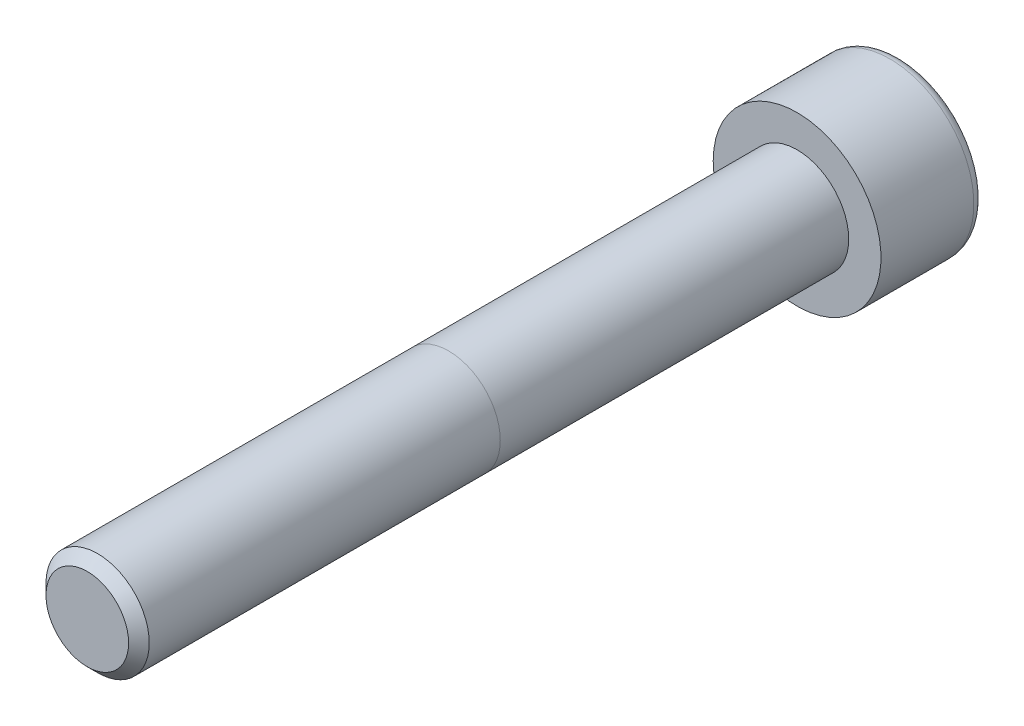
from build123d import *

# Parameters (mm, degrees)
ENLEV_MAT_EXTRU1_DEPTH = 4
ESQUISSE3_W            = 4
ESQUISSE3_H            = 55
CHANFREIN1_SIZE        = 0.8


with BuildPart() as part:
    # Esquisse1 → Base-R_volution (revolve)
    with BuildSketch(Plane(origin=(0, 0, 0), x_dir=(1, 0, 0), z_dir=(0, 1, 0)), mode=Mode.PRIVATE) as base_r_volution_sk:
        with BuildLine():
            Line((0, 0), (6.5, 0))
            Line((6.5, 0), (6.5, 7.2))
            ThreePointArc((6.5, 7.2), (6.265685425, 7.765685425), (5.7, 8))
            Line((5.7, 8), (0, 8))
            Line((0, 8), (0, 0))
        make_face()
    revolve(base_r_volution_sk.sketch.rotate(Axis((0, 0, 0), (0, 0, -1)), 180), axis=Axis((0, 0, 0), (0, 0, -1)))

    # Esquisse2 → enlev-mat-Extru1 (cut)
    with BuildSketch(Plane.XY.offset(-8)):
        Polygon((3, -1.732050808), (3, 1.732050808), (0, 3.464101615), (-3, 1.732050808), (-3, -1.732050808), (0, -3.464101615), align=None)
    extrude(amount=ENLEV_MAT_EXTRU1_DEPTH, mode=Mode.SUBTRACT)

    # Esquisse3 → Boss.-R_vol.1 (revolve)
    with BuildSketch(Plane(origin=(0, 0, 0), x_dir=(1, 0, 0), z_dir=(0, 1, 0))):
        with Locations((2, -27.5)):
            Rectangle(ESQUISSE3_W, ESQUISSE3_H)
    revolve(axis=Axis((0, 0, 0), (0, 0, 1)))

    # Chanfrein1
    chanfrein1_edges = [part.edges().sort_by_distance(p)[0] for p in [
        (-4, 0, 55),
    ]]
    chamfer(chanfrein1_edges, length=CHANFREIN1_SIZE)


solid = part.part
